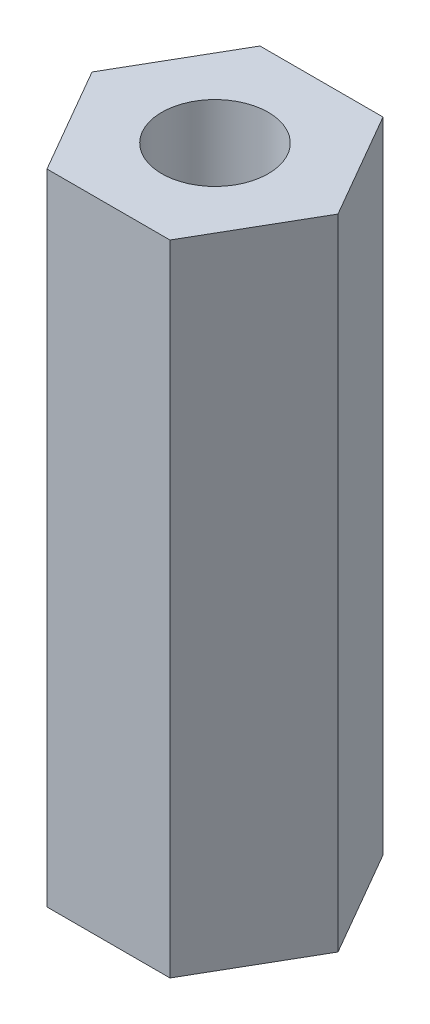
from build123d import *

# Parameters (mm, degrees)
SKETCH1_R           = 1.27
BOSS_EXTRUDE1_DEPTH = 15.24


with BuildPart() as part:
    # Sketch1 → Boss-Extrude1 (new body)
    with BuildSketch(Plane(origin=(0, 0, 0), x_dir=(1, 0, 0), z_dir=(0, 1, 0))):
        Polygon((2.932939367, 0), (1.466469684, 2.54), (-1.466469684, 2.54), (-2.932939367, 0), (-1.466469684, -2.54), (1.466469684, -2.54), align=None)
        with Locations(Location((0, 0, 0), (0, 0, 90))):
            Circle(SKETCH1_R, mode=Mode.SUBTRACT)
    extrude(amount=BOSS_EXTRUDE1_DEPTH)


solid = part.part
